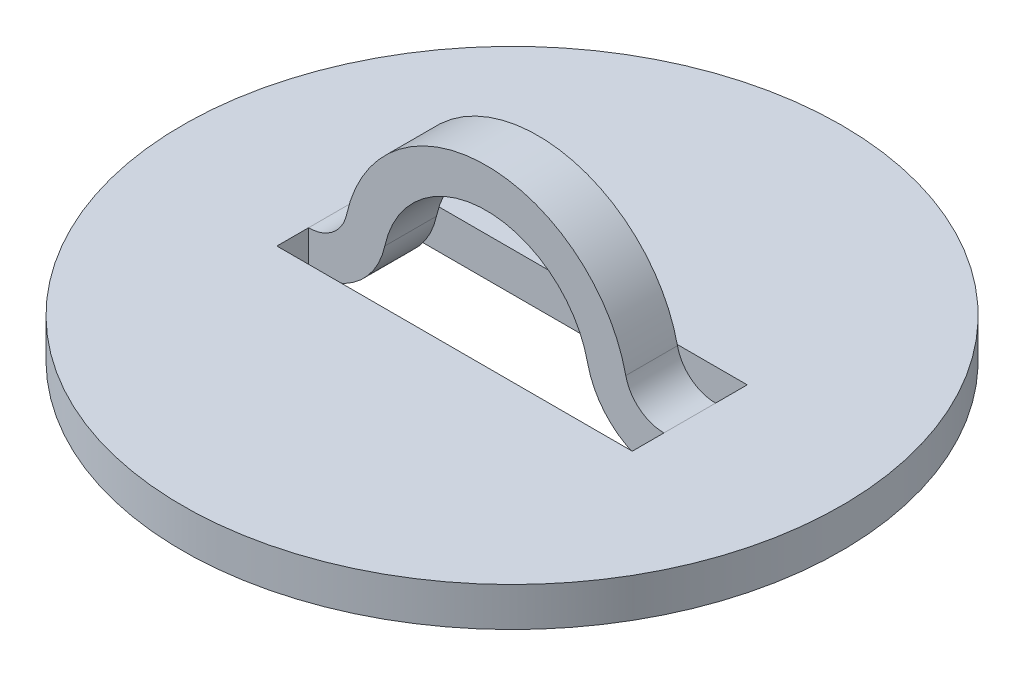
ISO-10303-21;
HEADER;
FILE_DESCRIPTION(('STEP AP214'),'2;1');
FILE_NAME('part.step','',(''),(''),'','','');
FILE_SCHEMA(('AUTOMOTIVE_DESIGN { 1 0 10303 214 1 1 1 1 }'));
ENDSEC;
DATA;
#1=APPLICATION_CONTEXT('core data for automotive mechanical design processes');
#2=APPLICATION_PROTOCOL_DEFINITION('international standard','automotive_design',2000,#1);
#3=PRODUCT_CONTEXT('',#1,'mechanical');
#4=PRODUCT('Part','Part','',(#3));
#5=PRODUCT_RELATED_PRODUCT_CATEGORY('part','',(#4));
#6=PRODUCT_DEFINITION_FORMATION('','',#4);
#7=PRODUCT_DEFINITION_CONTEXT('part definition',#1,'design');
#8=PRODUCT_DEFINITION('design','',#6,#7);
#9=PRODUCT_DEFINITION_SHAPE('','',#8);
#10=(LENGTH_UNIT() NAMED_UNIT(*) SI_UNIT(.MILLI.,.METRE.));
#11=(NAMED_UNIT(*) PLANE_ANGLE_UNIT() SI_UNIT($,.RADIAN.));
#12=(NAMED_UNIT(*) SI_UNIT($,.STERADIAN.) SOLID_ANGLE_UNIT());
#13=UNCERTAINTY_MEASURE_WITH_UNIT(LENGTH_MEASURE(1.E-05),#10,'distance_accuracy_value','');
#14=(GEOMETRIC_REPRESENTATION_CONTEXT(3) GLOBAL_UNCERTAINTY_ASSIGNED_CONTEXT((#13)) GLOBAL_UNIT_ASSIGNED_CONTEXT((#10,
#11,#12)) REPRESENTATION_CONTEXT('',''));
#15=CARTESIAN_POINT('',(0.,0.,0.));
#16=DIRECTION('',(0.,0.,1.));
#17=DIRECTION('',(1.,0.,0.));
#18=AXIS2_PLACEMENT_3D('',#15,#16,#17);
#19=CARTESIAN_POINT('',(-8.55904625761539,1.8796,2.4892));
#20=DIRECTION('',(0.,0.,1.));
#21=DIRECTION('',(1.,0.,0.));
#22=AXIS2_PLACEMENT_3D('',#19,#20,#21);
#23=PLANE('',#22);
#24=DIRECTION('',(0.,-1.,0.));
#25=VECTOR('',#24,1.);
#26=CARTESIAN_POINT('',(8.55904625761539,0.,2.4892));
#27=LINE('',#26,#25);
#28=CARTESIAN_POINT('',(8.55904625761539,0.,2.4892));
#29=VERTEX_POINT('',#28);
#30=CARTESIAN_POINT('',(8.55904625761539,-1.8796,2.4892));
#31=VERTEX_POINT('',#30);
#32=EDGE_CURVE('E232',#29,#31,#27,.T.);
#33=ORIENTED_EDGE('',*,*,#32,.F.);
#34=CARTESIAN_POINT('',(8.55904625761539,1.8796,2.4892));
#35=DIRECTION('',(0.,0.,-1.));
#36=DIRECTION('',(-1.,0.,0.));
#37=AXIS2_PLACEMENT_3D('',#34,#35,#36);
#38=CIRCLE('',#37,1.8796);
#39=CARTESIAN_POINT('',(6.72319285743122,1.47643942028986,2.4892));
#40=VERTEX_POINT('',#39);
#41=EDGE_CURVE('E172',#29,#40,#38,.T.);
#42=ORIENTED_EDGE('',*,*,#41,.T.);
#43=CARTESIAN_POINT('',(0.,0.,2.4892));
#44=DIRECTION('',(0.,0.,1.));
#45=DIRECTION('',(1.,0.,0.));
#46=AXIS2_PLACEMENT_3D('',#43,#44,#45);
#47=CIRCLE('',#46,6.8834);
#48=CARTESIAN_POINT('',(-6.72319285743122,1.47643942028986,2.4892));
#49=VERTEX_POINT('',#48);
#50=EDGE_CURVE('E174',#40,#49,#47,.T.);
#51=ORIENTED_EDGE('',*,*,#50,.T.);
#52=CARTESIAN_POINT('',(-8.55904625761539,1.8796,2.4892));
#53=DIRECTION('',(0.,0.,-1.));
#54=DIRECTION('',(1.,0.,0.));
#55=AXIS2_PLACEMENT_3D('',#52,#53,#54);
#56=CIRCLE('',#55,1.8796);
#57=CARTESIAN_POINT('',(-8.55904625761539,0.,2.4892));
#58=VERTEX_POINT('',#57);
#59=EDGE_CURVE('E176',#49,#58,#56,.T.);
#60=ORIENTED_EDGE('',*,*,#59,.T.);
#61=DIRECTION('',(0.,1.,0.));
#62=VECTOR('',#61,1.);
#63=CARTESIAN_POINT('',(-8.55904625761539,-1.8796,2.4892));
#64=LINE('',#63,#62);
#65=CARTESIAN_POINT('',(-8.55904625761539,-1.8796,2.4892));
#66=VERTEX_POINT('',#65);
#67=EDGE_CURVE('E237',#66,#58,#64,.T.);
#68=ORIENTED_EDGE('',*,*,#67,.F.);
#69=CARTESIAN_POINT('',(-8.55904625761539,1.8796,2.4892));
#70=DIRECTION('',(0.,0.,1.));
#71=DIRECTION('',(1.,0.,0.));
#72=AXIS2_PLACEMENT_3D('',#69,#70,#71);
#73=CIRCLE('',#72,3.7592);
#74=CARTESIAN_POINT('',(-4.88733945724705,1.07327884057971,2.4892));
#75=VERTEX_POINT('',#74);
#76=EDGE_CURVE('E164',#66,#75,#73,.T.);
#77=ORIENTED_EDGE('',*,*,#76,.T.);
#78=CARTESIAN_POINT('',(0.,0.,2.4892));
#79=DIRECTION('',(0.,0.,-1.));
#80=DIRECTION('',(1.,0.,0.));
#81=AXIS2_PLACEMENT_3D('',#78,#79,#80);
#82=CIRCLE('',#81,5.0038);
#83=CARTESIAN_POINT('',(4.88733945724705,1.07327884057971,2.4892));
#84=VERTEX_POINT('',#83);
#85=EDGE_CURVE('E166',#75,#84,#82,.T.);
#86=ORIENTED_EDGE('',*,*,#85,.T.);
#87=CARTESIAN_POINT('',(8.55904625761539,1.8796,2.4892));
#88=DIRECTION('',(0.,0.,1.));
#89=DIRECTION('',(-1.,0.,0.));
#90=AXIS2_PLACEMENT_3D('',#87,#88,#89);
#91=CIRCLE('',#90,3.7592);
#92=EDGE_CURVE('E169',#84,#31,#91,.T.);
#93=ORIENTED_EDGE('',*,*,#92,.T.);
#94=EDGE_LOOP('',(#33,#42,#51,#60,#68,#77,#86,#93));
#95=FACE_BOUND('',#94,.T.);
#96=ADVANCED_FACE('F37',(#95),#23,.T.);
#97=CARTESIAN_POINT('',(-8.55904625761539,1.8796,0.));
#98=DIRECTION('',(0.,0.,1.));
#99=DIRECTION('',(1.,0.,0.));
#100=AXIS2_PLACEMENT_3D('',#97,#98,#99);
#101=PLANE('',#100);
#102=CARTESIAN_POINT('',(8.55904625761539,1.8796,0.));
#103=DIRECTION('',(0.,0.,-1.));
#104=DIRECTION('',(-1.,0.,0.));
#105=AXIS2_PLACEMENT_3D('',#102,#103,#104);
#106=CIRCLE('',#105,1.8796);
#107=CARTESIAN_POINT('',(8.55904625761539,0.,0.));
#108=VERTEX_POINT('',#107);
#109=CARTESIAN_POINT('',(6.72319285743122,1.47643942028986,0.));
#110=VERTEX_POINT('',#109);
#111=EDGE_CURVE('E186',#108,#110,#106,.T.);
#112=ORIENTED_EDGE('',*,*,#111,.F.);
#113=DIRECTION('',(0.,1.,0.));
#114=VECTOR('',#113,1.);
#115=CARTESIAN_POINT('',(8.55904625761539,-1.8796,0.));
#116=LINE('',#115,#114);
#117=CARTESIAN_POINT('',(8.55904625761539,-1.8796,0.));
#118=VERTEX_POINT('',#117);
#119=EDGE_CURVE('E131',#118,#108,#116,.T.);
#120=ORIENTED_EDGE('',*,*,#119,.F.);
#121=CARTESIAN_POINT('',(8.55904625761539,1.8796,0.));
#122=DIRECTION('',(0.,0.,1.));
#123=DIRECTION('',(-1.,0.,0.));
#124=AXIS2_PLACEMENT_3D('',#121,#122,#123);
#125=CIRCLE('',#124,3.7592);
#126=CARTESIAN_POINT('',(4.88733945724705,1.07327884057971,0.));
#127=VERTEX_POINT('',#126);
#128=EDGE_CURVE('E183',#127,#118,#125,.T.);
#129=ORIENTED_EDGE('',*,*,#128,.F.);
#130=CARTESIAN_POINT('',(0.,0.,0.));
#131=DIRECTION('',(0.,0.,-1.));
#132=DIRECTION('',(1.,0.,0.));
#133=AXIS2_PLACEMENT_3D('',#130,#131,#132);
#134=CIRCLE('',#133,5.0038);
#135=CARTESIAN_POINT('',(-4.88733945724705,1.07327884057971,0.));
#136=VERTEX_POINT('',#135);
#137=EDGE_CURVE('E181',#136,#127,#134,.T.);
#138=ORIENTED_EDGE('',*,*,#137,.F.);
#139=CARTESIAN_POINT('',(-8.55904625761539,1.8796,0.));
#140=DIRECTION('',(0.,0.,1.));
#141=DIRECTION('',(1.,0.,0.));
#142=AXIS2_PLACEMENT_3D('',#139,#140,#141);
#143=CIRCLE('',#142,3.7592);
#144=CARTESIAN_POINT('',(-8.55904625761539,-1.8796,0.));
#145=VERTEX_POINT('',#144);
#146=EDGE_CURVE('E162',#145,#136,#143,.T.);
#147=ORIENTED_EDGE('',*,*,#146,.F.);
#148=DIRECTION('',(0.,-1.,0.));
#149=VECTOR('',#148,1.);
#150=CARTESIAN_POINT('',(-8.55904625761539,0.,0.));
#151=LINE('',#150,#149);
#152=CARTESIAN_POINT('',(-8.55904625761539,0.,0.));
#153=VERTEX_POINT('',#152);
#154=EDGE_CURVE('E243',#153,#145,#151,.T.);
#155=ORIENTED_EDGE('',*,*,#154,.F.);
#156=CARTESIAN_POINT('',(-8.55904625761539,1.8796,0.));
#157=DIRECTION('',(0.,0.,-1.));
#158=DIRECTION('',(1.,0.,0.));
#159=AXIS2_PLACEMENT_3D('',#156,#157,#158);
#160=CIRCLE('',#159,1.8796);
#161=CARTESIAN_POINT('',(-6.72319285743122,1.47643942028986,0.));
#162=VERTEX_POINT('',#161);
#163=EDGE_CURVE('E167',#162,#153,#160,.T.);
#164=ORIENTED_EDGE('',*,*,#163,.F.);
#165=CARTESIAN_POINT('',(0.,0.,0.));
#166=DIRECTION('',(0.,0.,1.));
#167=DIRECTION('',(1.,0.,0.));
#168=AXIS2_PLACEMENT_3D('',#165,#166,#167);
#169=CIRCLE('',#168,6.8834);
#170=EDGE_CURVE('E188',#110,#162,#169,.T.);
#171=ORIENTED_EDGE('',*,*,#170,.F.);
#172=EDGE_LOOP('',(#112,#120,#129,#138,#147,#155,#164,#171));
#173=FACE_BOUND('',#172,.T.);
#174=ADVANCED_FACE('F219',(#173),#101,.F.);
#175=CARTESIAN_POINT('',(-8.55904625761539,1.8796,2.4892));
#176=DIRECTION('',(0.,0.,-1.));
#177=DIRECTION('',(-1.,0.,0.));
#178=AXIS2_PLACEMENT_3D('',#175,#176,#177);
#179=CYLINDRICAL_SURFACE('',#178,3.7592);
#180=ORIENTED_EDGE('',*,*,#146,.T.);
#181=DIRECTION('',(0.,0.,-1.));
#182=VECTOR('',#181,1.);
#183=CARTESIAN_POINT('',(-4.88733945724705,1.07327884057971,2.4892));
#184=LINE('',#183,#182);
#185=EDGE_CURVE('E45',#75,#136,#184,.T.);
#186=ORIENTED_EDGE('',*,*,#185,.F.);
#187=ORIENTED_EDGE('',*,*,#76,.F.);
#188=DIRECTION('',(0.,0.,-1.));
#189=VECTOR('',#188,1.);
#190=CARTESIAN_POINT('',(-8.55904625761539,-1.8796,2.4892));
#191=LINE('',#190,#189);
#192=EDGE_CURVE('E11',#66,#145,#191,.T.);
#193=ORIENTED_EDGE('',*,*,#192,.T.);
#194=EDGE_LOOP('',(#180,#186,#187,#193));
#195=FACE_BOUND('',#194,.T.);
#196=ADVANCED_FACE('F39',(#195),#179,.T.);
#197=CARTESIAN_POINT('',(0.,0.,2.4892));
#198=DIRECTION('',(0.,0.,-1.));
#199=DIRECTION('',(-1.,0.,0.));
#200=AXIS2_PLACEMENT_3D('',#197,#198,#199);
#201=CYLINDRICAL_SURFACE('',#200,5.0038);
#202=ORIENTED_EDGE('',*,*,#137,.T.);
#203=DIRECTION('',(0.,0.,-1.));
#204=VECTOR('',#203,1.);
#205=CARTESIAN_POINT('',(4.88733945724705,1.07327884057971,2.4892));
#206=LINE('',#205,#204);
#207=EDGE_CURVE('E204',#84,#127,#206,.T.);
#208=ORIENTED_EDGE('',*,*,#207,.F.);
#209=ORIENTED_EDGE('',*,*,#85,.F.);
#210=ORIENTED_EDGE('',*,*,#185,.T.);
#211=EDGE_LOOP('',(#202,#208,#209,#210));
#212=FACE_BOUND('',#211,.T.);
#213=ADVANCED_FACE('F211',(#212),#201,.F.);
#214=CARTESIAN_POINT('',(8.55904625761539,1.8796,2.4892));
#215=DIRECTION('',(0.,0.,-1.));
#216=DIRECTION('',(-1.,0.,0.));
#217=AXIS2_PLACEMENT_3D('',#214,#215,#216);
#218=CYLINDRICAL_SURFACE('',#217,3.7592);
#219=ORIENTED_EDGE('',*,*,#128,.T.);
#220=DIRECTION('',(0.,0.,-1.));
#221=VECTOR('',#220,1.);
#222=CARTESIAN_POINT('',(8.55904625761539,-1.8796,2.4892));
#223=LINE('',#222,#221);
#224=EDGE_CURVE('E201',#31,#118,#223,.T.);
#225=ORIENTED_EDGE('',*,*,#224,.F.);
#226=ORIENTED_EDGE('',*,*,#92,.F.);
#227=ORIENTED_EDGE('',*,*,#207,.T.);
#228=EDGE_LOOP('',(#219,#225,#226,#227));
#229=FACE_BOUND('',#228,.T.);
#230=ADVANCED_FACE('F223',(#229),#218,.T.);
#231=CARTESIAN_POINT('',(8.55904625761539,-1.8796,2.4892));
#232=DIRECTION('',(0.,1.,0.));
#233=DIRECTION('',(0.,0.,1.));
#234=AXIS2_PLACEMENT_3D('',#231,#232,#233);
#235=PLANE('',#234);
#236=DIRECTION('',(0.,0.,-1.));
#237=VECTOR('',#236,1.);
#238=CARTESIAN_POINT('',(-8.55904625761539,-1.8796,0.));
#239=LINE('',#238,#237);
#240=CARTESIAN_POINT('',(-8.55904625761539,-1.8796,-1.524));
#241=VERTEX_POINT('',#240);
#242=EDGE_CURVE('E241',#145,#241,#239,.T.);
#243=ORIENTED_EDGE('',*,*,#242,.F.);
#244=ORIENTED_EDGE('',*,*,#192,.F.);
#245=DIRECTION('',(0.,0.,-1.));
#246=VECTOR('',#245,1.);
#247=CARTESIAN_POINT('',(-8.55904625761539,-1.8796,4.0132));
#248=LINE('',#247,#246);
#249=CARTESIAN_POINT('',(-8.55904625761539,-1.8796,4.0132));
#250=VERTEX_POINT('',#249);
#251=EDGE_CURVE('E239',#250,#66,#248,.T.);
#252=ORIENTED_EDGE('',*,*,#251,.F.);
#253=DIRECTION('',(-1.,0.,0.));
#254=VECTOR('',#253,1.);
#255=CARTESIAN_POINT('',(-11.7340462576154,-1.8796,4.0132));
#256=LINE('',#255,#254);
#257=CARTESIAN_POINT('',(8.55904625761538,-1.8796,4.0132));
#258=VERTEX_POINT('',#257);
#259=EDGE_CURVE('E157',#258,#250,#256,.T.);
#260=ORIENTED_EDGE('',*,*,#259,.F.);
#261=DIRECTION('',(0.,0.,1.));
#262=VECTOR('',#261,1.);
#263=CARTESIAN_POINT('',(8.55904625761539,-1.8796,2.4892));
#264=LINE('',#263,#262);
#265=EDGE_CURVE('E52',#31,#258,#264,.T.);
#266=ORIENTED_EDGE('',*,*,#265,.F.);
#267=ORIENTED_EDGE('',*,*,#224,.T.);
#268=DIRECTION('',(0.,0.,1.));
#269=VECTOR('',#268,1.);
#270=CARTESIAN_POINT('',(8.55904625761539,-1.8796,-1.524));
#271=LINE('',#270,#269);
#272=CARTESIAN_POINT('',(8.55904625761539,-1.8796,-1.524));
#273=VERTEX_POINT('',#272);
#274=EDGE_CURVE('E140',#273,#118,#271,.T.);
#275=ORIENTED_EDGE('',*,*,#274,.F.);
#276=DIRECTION('',(1.,0.,0.));
#277=VECTOR('',#276,1.);
#278=CARTESIAN_POINT('',(-11.7340462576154,-1.8796,-1.524));
#279=LINE('',#278,#277);
#280=EDGE_CURVE('E138',#241,#273,#279,.T.);
#281=ORIENTED_EDGE('',*,*,#280,.F.);
#282=EDGE_LOOP('',(#243,#244,#252,#260,#266,#267,#275,#281));
#283=FACE_BOUND('',#282,.T.);
#284=CARTESIAN_POINT('',(0.,-1.8796,1.2446));
#285=DIRECTION('',(0.,-1.,0.));
#286=DIRECTION('',(0.,0.,-1.));
#287=AXIS2_PLACEMENT_3D('',#284,#285,#286);
#288=CIRCLE('',#287,15.875);
#289=CARTESIAN_POINT('',(0.,-1.8796,-14.6304));
#290=VERTEX_POINT('',#289);
#291=EDGE_CURVE('E148',#290,#290,#288,.T.);
#292=ORIENTED_EDGE('',*,*,#291,.T.);
#293=EDGE_LOOP('',(#292));
#294=FACE_BOUND('',#293,.T.);
#295=ADVANCED_FACE('F227',(#283,#294),#235,.F.);
#296=CARTESIAN_POINT('',(8.55904625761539,1.8796,2.4892));
#297=DIRECTION('',(0.,0.,-1.));
#298=DIRECTION('',(-1.,0.,0.));
#299=AXIS2_PLACEMENT_3D('',#296,#297,#298);
#300=CYLINDRICAL_SURFACE('',#299,1.8796);
#301=ORIENTED_EDGE('',*,*,#111,.T.);
#302=DIRECTION('',(0.,0.,-1.));
#303=VECTOR('',#302,1.);
#304=CARTESIAN_POINT('',(6.72319285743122,1.47643942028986,2.4892));
#305=LINE('',#304,#303);
#306=EDGE_CURVE('E196',#40,#110,#305,.T.);
#307=ORIENTED_EDGE('',*,*,#306,.F.);
#308=ORIENTED_EDGE('',*,*,#41,.F.);
#309=DIRECTION('',(0.,0.,-1.));
#310=VECTOR('',#309,1.);
#311=CARTESIAN_POINT('',(8.55904625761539,0.,2.4892));
#312=LINE('',#311,#310);
#313=EDGE_CURVE('E199',#29,#108,#312,.T.);
#314=ORIENTED_EDGE('',*,*,#313,.T.);
#315=EDGE_LOOP('',(#301,#307,#308,#314));
#316=FACE_BOUND('',#315,.T.);
#317=ADVANCED_FACE('F272',(#316),#300,.F.);
#318=CARTESIAN_POINT('',(0.,0.,2.4892));
#319=DIRECTION('',(0.,0.,-1.));
#320=DIRECTION('',(-1.,0.,0.));
#321=AXIS2_PLACEMENT_3D('',#318,#319,#320);
#322=CYLINDRICAL_SURFACE('',#321,6.8834);
#323=ORIENTED_EDGE('',*,*,#170,.T.);
#324=DIRECTION('',(0.,0.,-1.));
#325=VECTOR('',#324,1.);
#326=CARTESIAN_POINT('',(-6.72319285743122,1.47643942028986,2.4892));
#327=LINE('',#326,#325);
#328=EDGE_CURVE('E193',#49,#162,#327,.T.);
#329=ORIENTED_EDGE('',*,*,#328,.F.);
#330=ORIENTED_EDGE('',*,*,#50,.F.);
#331=ORIENTED_EDGE('',*,*,#306,.T.);
#332=EDGE_LOOP('',(#323,#329,#330,#331));
#333=FACE_BOUND('',#332,.T.);
#334=ADVANCED_FACE('F278',(#333),#322,.T.);
#335=CARTESIAN_POINT('',(-8.55904625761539,1.8796,2.4892));
#336=DIRECTION('',(0.,0.,-1.));
#337=DIRECTION('',(-1.,0.,0.));
#338=AXIS2_PLACEMENT_3D('',#335,#336,#337);
#339=CYLINDRICAL_SURFACE('',#338,1.8796);
#340=ORIENTED_EDGE('',*,*,#163,.T.);
#341=DIRECTION('',(0.,0.,-1.));
#342=VECTOR('',#341,1.);
#343=CARTESIAN_POINT('',(-8.55904625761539,0.,2.4892));
#344=LINE('',#343,#342);
#345=EDGE_CURVE('E179',#58,#153,#344,.T.);
#346=ORIENTED_EDGE('',*,*,#345,.F.);
#347=ORIENTED_EDGE('',*,*,#59,.F.);
#348=ORIENTED_EDGE('',*,*,#328,.T.);
#349=EDGE_LOOP('',(#340,#346,#347,#348));
#350=FACE_BOUND('',#349,.T.);
#351=ADVANCED_FACE('F282',(#350),#339,.F.);
#352=CARTESIAN_POINT('',(-15.875,0.,2.4892));
#353=DIRECTION('',(0.,-1.,0.));
#354=DIRECTION('',(1.,0.,0.));
#355=AXIS2_PLACEMENT_3D('',#352,#353,#354);
#356=PLANE('',#355);
#357=DIRECTION('',(0.,0.,-1.));
#358=VECTOR('',#357,1.);
#359=CARTESIAN_POINT('',(8.55904625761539,0.,0.));
#360=LINE('',#359,#358);
#361=CARTESIAN_POINT('',(8.55904625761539,0.,-1.524));
#362=VERTEX_POINT('',#361);
#363=EDGE_CURVE('E126',#108,#362,#360,.T.);
#364=ORIENTED_EDGE('',*,*,#363,.F.);
#365=ORIENTED_EDGE('',*,*,#313,.F.);
#366=DIRECTION('',(0.,0.,-1.));
#367=VECTOR('',#366,1.);
#368=CARTESIAN_POINT('',(8.55904625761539,0.,4.0132));
#369=LINE('',#368,#367);
#370=CARTESIAN_POINT('',(8.55904625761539,0.,4.0132));
#371=VERTEX_POINT('',#370);
#372=EDGE_CURVE('E139',#371,#29,#369,.T.);
#373=ORIENTED_EDGE('',*,*,#372,.F.);
#374=DIRECTION('',(-1.,0.,0.));
#375=VECTOR('',#374,1.);
#376=CARTESIAN_POINT('',(-11.7340462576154,0.,4.0132));
#377=LINE('',#376,#375);
#378=CARTESIAN_POINT('',(-8.55904625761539,0.,4.0132));
#379=VERTEX_POINT('',#378);
#380=EDGE_CURVE('E149',#371,#379,#377,.T.);
#381=ORIENTED_EDGE('',*,*,#380,.T.);
#382=DIRECTION('',(0.,0.,1.));
#383=VECTOR('',#382,1.);
#384=CARTESIAN_POINT('',(-8.55904625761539,0.,2.4892));
#385=LINE('',#384,#383);
#386=EDGE_CURVE('E253',#58,#379,#385,.T.);
#387=ORIENTED_EDGE('',*,*,#386,.F.);
#388=ORIENTED_EDGE('',*,*,#345,.T.);
#389=DIRECTION('',(0.,0.,1.));
#390=VECTOR('',#389,1.);
#391=CARTESIAN_POINT('',(-8.55904625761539,0.,-1.524));
#392=LINE('',#391,#390);
#393=CARTESIAN_POINT('',(-8.55904625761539,0.,-1.524));
#394=VERTEX_POINT('',#393);
#395=EDGE_CURVE('E146',#394,#153,#392,.T.);
#396=ORIENTED_EDGE('',*,*,#395,.F.);
#397=DIRECTION('',(1.,0.,0.));
#398=VECTOR('',#397,1.);
#399=CARTESIAN_POINT('',(-11.7340462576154,0.,-1.524));
#400=LINE('',#399,#398);
#401=EDGE_CURVE('E60',#394,#362,#400,.T.);
#402=ORIENTED_EDGE('',*,*,#401,.T.);
#403=EDGE_LOOP('',(#364,#365,#373,#381,#387,#388,#396,#402));
#404=FACE_BOUND('',#403,.T.);
#405=CARTESIAN_POINT('',(0.,0.,1.2446));
#406=DIRECTION('',(0.,-1.,0.));
#407=DIRECTION('',(0.,0.,-1.));
#408=AXIS2_PLACEMENT_3D('',#405,#406,#407);
#409=CIRCLE('',#408,15.875);
#410=CARTESIAN_POINT('',(0.,0.,-14.6304));
#411=VERTEX_POINT('',#410);
#412=EDGE_CURVE('E152',#411,#411,#409,.T.);
#413=ORIENTED_EDGE('',*,*,#412,.F.);
#414=EDGE_LOOP('',(#413));
#415=FACE_BOUND('',#414,.T.);
#416=ADVANCED_FACE('F142',(#404,#415),#356,.F.);
#417=CARTESIAN_POINT('',(-11.7340462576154,0.,-1.524));
#418=DIRECTION('',(0.,0.,-1.));
#419=DIRECTION('',(-1.,0.,0.));
#420=AXIS2_PLACEMENT_3D('',#417,#418,#419);
#421=PLANE('',#420);
#422=ORIENTED_EDGE('',*,*,#280,.T.);
#423=DIRECTION('',(0.,-1.,0.));
#424=VECTOR('',#423,1.);
#425=CARTESIAN_POINT('',(8.55904625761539,0.,-1.524));
#426=LINE('',#425,#424);
#427=EDGE_CURVE('E128',#362,#273,#426,.T.);
#428=ORIENTED_EDGE('',*,*,#427,.F.);
#429=ORIENTED_EDGE('',*,*,#401,.F.);
#430=DIRECTION('',(0.,1.,0.));
#431=VECTOR('',#430,1.);
#432=CARTESIAN_POINT('',(-8.55904625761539,-1.8796,-1.524));
#433=LINE('',#432,#431);
#434=EDGE_CURVE('E249',#241,#394,#433,.T.);
#435=ORIENTED_EDGE('',*,*,#434,.F.);
#436=EDGE_LOOP('',(#422,#428,#429,#435));
#437=FACE_BOUND('',#436,.T.);
#438=ADVANCED_FACE('F136',(#437),#421,.F.);
#439=CARTESIAN_POINT('',(0.,0.,1.2446));
#440=DIRECTION('',(0.,-1.,0.));
#441=DIRECTION('',(0.,0.,-1.));
#442=AXIS2_PLACEMENT_3D('',#439,#440,#441);
#443=CYLINDRICAL_SURFACE('',#442,15.875);
#444=ORIENTED_EDGE('',*,*,#291,.F.);
#445=EDGE_LOOP('',(#444));
#446=FACE_BOUND('',#445,.T.);
#447=ORIENTED_EDGE('',*,*,#412,.T.);
#448=EDGE_LOOP('',(#447));
#449=FACE_BOUND('',#448,.T.);
#450=ADVANCED_FACE('F299',(#446,#449),#443,.T.);
#451=CARTESIAN_POINT('',(-11.7340462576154,0.,4.0132));
#452=DIRECTION('',(0.,0.,1.));
#453=DIRECTION('',(1.,0.,0.));
#454=AXIS2_PLACEMENT_3D('',#451,#452,#453);
#455=PLANE('',#454);
#456=ORIENTED_EDGE('',*,*,#380,.F.);
#457=DIRECTION('',(0.,1.,0.));
#458=VECTOR('',#457,1.);
#459=CARTESIAN_POINT('',(8.55904625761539,-1.8796,4.0132));
#460=LINE('',#459,#458);
#461=EDGE_CURVE('E231',#258,#371,#460,.T.);
#462=ORIENTED_EDGE('',*,*,#461,.F.);
#463=ORIENTED_EDGE('',*,*,#259,.T.);
#464=DIRECTION('',(0.,-1.,0.));
#465=VECTOR('',#464,1.);
#466=CARTESIAN_POINT('',(-8.55904625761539,0.,4.0132));
#467=LINE('',#466,#465);
#468=EDGE_CURVE('E159',#379,#250,#467,.T.);
#469=ORIENTED_EDGE('',*,*,#468,.F.);
#470=EDGE_LOOP('',(#456,#462,#463,#469));
#471=FACE_BOUND('',#470,.T.);
#472=ADVANCED_FACE('F262',(#471),#455,.F.);
#473=CARTESIAN_POINT('',(-8.55904625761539,0.,0.));
#474=DIRECTION('',(1.,0.,0.));
#475=DIRECTION('',(0.,0.,-1.));
#476=AXIS2_PLACEMENT_3D('',#473,#474,#475);
#477=PLANE('',#476);
#478=ORIENTED_EDGE('',*,*,#251,.T.);
#479=ORIENTED_EDGE('',*,*,#67,.T.);
#480=ORIENTED_EDGE('',*,*,#386,.T.);
#481=ORIENTED_EDGE('',*,*,#468,.T.);
#482=EDGE_LOOP('',(#478,#479,#480,#481));
#483=FACE_BOUND('',#482,.T.);
#484=ADVANCED_FACE('F258',(#483),#477,.T.);
#485=CARTESIAN_POINT('',(-8.55904625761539,0.,0.));
#486=DIRECTION('',(1.,0.,0.));
#487=DIRECTION('',(0.,0.,-1.));
#488=AXIS2_PLACEMENT_3D('',#485,#486,#487);
#489=PLANE('',#488);
#490=ORIENTED_EDGE('',*,*,#434,.T.);
#491=ORIENTED_EDGE('',*,*,#395,.T.);
#492=ORIENTED_EDGE('',*,*,#154,.T.);
#493=ORIENTED_EDGE('',*,*,#242,.T.);
#494=EDGE_LOOP('',(#490,#491,#492,#493));
#495=FACE_BOUND('',#494,.T.);
#496=ADVANCED_FACE('F283',(#495),#489,.T.);
#497=CARTESIAN_POINT('',(8.55904625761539,0.,0.));
#498=DIRECTION('',(-1.,0.,0.));
#499=DIRECTION('',(0.,0.,1.));
#500=AXIS2_PLACEMENT_3D('',#497,#498,#499);
#501=PLANE('',#500);
#502=ORIENTED_EDGE('',*,*,#372,.T.);
#503=ORIENTED_EDGE('',*,*,#32,.T.);
#504=ORIENTED_EDGE('',*,*,#265,.T.);
#505=ORIENTED_EDGE('',*,*,#461,.T.);
#506=EDGE_LOOP('',(#502,#503,#504,#505));
#507=FACE_BOUND('',#506,.T.);
#508=ADVANCED_FACE('F264',(#507),#501,.T.);
#509=CARTESIAN_POINT('',(8.55904625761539,0.,0.));
#510=DIRECTION('',(-1.,0.,0.));
#511=DIRECTION('',(0.,0.,1.));
#512=AXIS2_PLACEMENT_3D('',#509,#510,#511);
#513=PLANE('',#512);
#514=ORIENTED_EDGE('',*,*,#427,.T.);
#515=ORIENTED_EDGE('',*,*,#274,.T.);
#516=ORIENTED_EDGE('',*,*,#119,.T.);
#517=ORIENTED_EDGE('',*,*,#363,.T.);
#518=EDGE_LOOP('',(#514,#515,#516,#517));
#519=FACE_BOUND('',#518,.T.);
#520=ADVANCED_FACE('F127',(#519),#513,.T.);
#521=CLOSED_SHELL('',(#96,#174,#196,#213,#230,#295,#317,#334,#351,#416,#438,#450,#472,#484,#496,
#508,#520));
#522=MANIFOLD_SOLID_BREP('B2',#521);
#523=ADVANCED_BREP_SHAPE_REPRESENTATION('',(#18,#522),#14);
#524=SHAPE_DEFINITION_REPRESENTATION(#9,#523);
ENDSEC;
END-ISO-10303-21;
